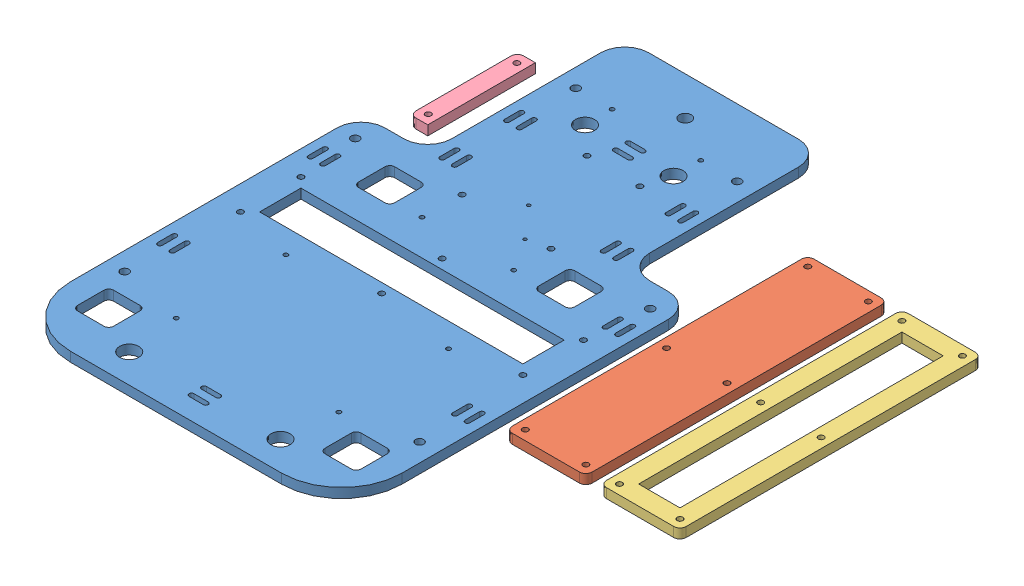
SolidWorks assembly BottomCutPattern.SLDASM, configuration Default (file format 12000). Lengths in mm.
Overall size (304.8 5.08 304.8).
4 component instances, 4 part files, 13 mates.
Components (placement in the parent):
- BottomPlate-1: BottomPlate.SLDPRT [Default] at (100.33 0 297.18) size (175.26 5.08 289.56)
- BatteryBase-1: BatteryBase.SLDPRT [Default] at (216.662 0 178.054) x (0 0 -1) z (1 0 0) size (159.51 5.08 42.16)
- BatteryRing-1: BatteryRing.SLDPRT [Default] at (266.446 0 178.054) x (0 0 -1) z (1 0 0) size (159.51 5.08 42.16)
- CameraSupport-1: CameraSupport.SLDPRT [Default] at (30.5435 0 56.388) x (0 0 1) z (-1 0 0) size (56.9 5.08 9.53)
Mates (geometry in assembly coordinates):
- Distance1: distance = 12.7 mm anti-aligned: plane of CameraSupport-1 through (35.306 5.08 42.164) normal (1 0 0); plane of BottomPlate-1 through (48.006 5.08 7.62) normal (-1 0 0)
- Coincident2: coincident aligned: plane of BottomPlate-1 through (100.33 5.08 297.18) normal (0 1 0); plane of CameraSupport-1 through (30.5435 5.08 56.388) normal (0 1 0)
- Coincident3: coincident aligned: plane of BottomPlate-1 through (100.33 5.08 297.18) normal (0 1 0); plane of BatteryBase-1 through (216.662 5.08 178.054) normal (0 1 0)
- Coincident4: coincident aligned: plane of BottomPlate-1 through (100.33 5.08 297.18) normal (0 1 0); plane of BatteryRing-1 through (266.446 5.08 178.054) normal (0 1 0)
- Distance2: distance = 12.7 mm anti-aligned: plane of CameraSupport-1 through (35.306 5.08 99.06) normal (0 0 1); plane of BottomPlate-1 through (48.006 5.08 111.76) normal (0 0 -1)
- Distance5: distance = 7.62 mm anti-aligned: plane of BatteryBase-1 through (195.58 5.08 217.932) normal (-1 0 0); plane of BottomPlate-1 through (187.96 5.08 111.76) normal (1 0 0)
- Distance6: distance = 7.62 mm anti-aligned: plane of BatteryRing-1 through (245.364 5.08 217.932) normal (-1 0 0); plane of BatteryBase-1 through (237.744 5.08 217.932) normal (1 0 0)
- Coincident15: coincident: plane of BottomPlate-1 through (100.33 0 297.18) normal (0 -1 0)
- Distance7: distance = 12.7 mm: plane of BottomPlate-1 through (12.7 5.08 111.76) normal (-1 0 0)
- Distance8: distance = 7.62 mm: plane of BottomPlate-1 through (100.33 5.08 7.62) normal (0 0 -1)
- Distance9: distance = 50.8 mm aligned: plane of BottomPlate-1 through (100.33 5.08 7.62) normal (0 0 -1); plane of BatteryBase-1 through (195.58 5.08 58.42) normal (0 0 -1)
- Coincident19: coincident aligned: plane of BatteryBase-1 through (195.58 5.08 58.42) normal (0 0 -1); plane of BatteryRing-1 through (245.364 5.08 58.42) normal (0 0 -1)
- Coincident20: coincident: plane of BottomPlate-1 through (100.33 0 297.18) normal (0 -1 0)
